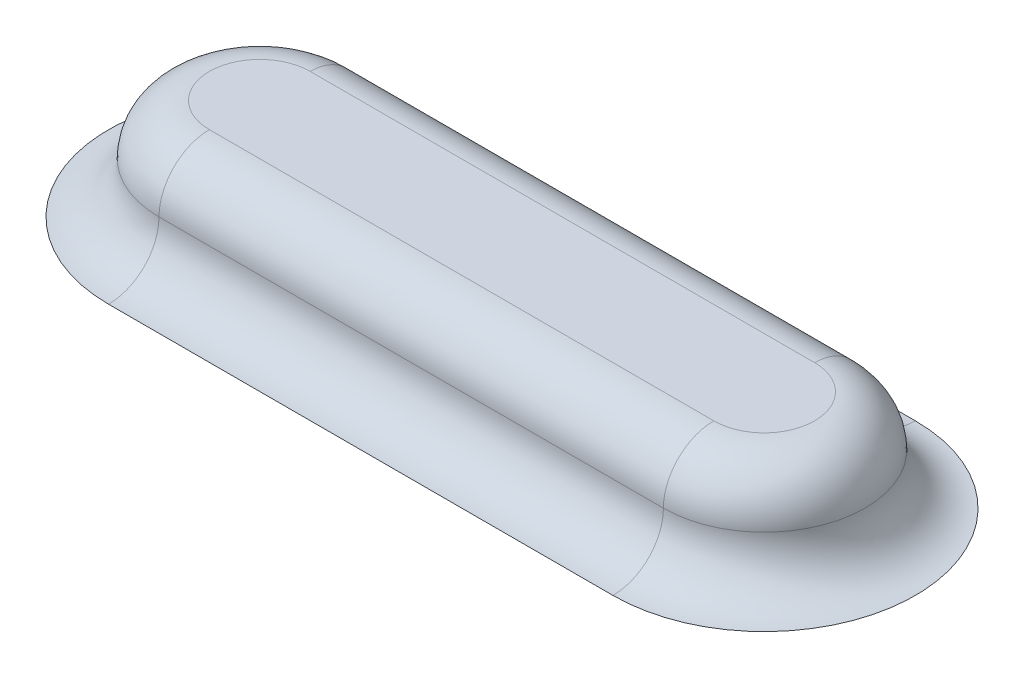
ISO-10303-21;
HEADER;
FILE_DESCRIPTION(('STEP AP214'),'2;1');
FILE_NAME('part.step','',(''),(''),'','','');
FILE_SCHEMA(('AUTOMOTIVE_DESIGN { 1 0 10303 214 1 1 1 1 }'));
ENDSEC;
DATA;
#1=APPLICATION_CONTEXT('core data for automotive mechanical design processes');
#2=APPLICATION_PROTOCOL_DEFINITION('international standard','automotive_design',2000,#1);
#3=PRODUCT_CONTEXT('',#1,'mechanical');
#4=PRODUCT('Part','Part','',(#3));
#5=PRODUCT_RELATED_PRODUCT_CATEGORY('part','',(#4));
#6=PRODUCT_DEFINITION_FORMATION('','',#4);
#7=PRODUCT_DEFINITION_CONTEXT('part definition',#1,'design');
#8=PRODUCT_DEFINITION('design','',#6,#7);
#9=PRODUCT_DEFINITION_SHAPE('','',#8);
#10=(LENGTH_UNIT() NAMED_UNIT(*) SI_UNIT(.MILLI.,.METRE.));
#11=(NAMED_UNIT(*) PLANE_ANGLE_UNIT() SI_UNIT($,.RADIAN.));
#12=(NAMED_UNIT(*) SI_UNIT($,.STERADIAN.) SOLID_ANGLE_UNIT());
#13=UNCERTAINTY_MEASURE_WITH_UNIT(LENGTH_MEASURE(1.E-05),#10,'distance_accuracy_value','');
#14=(GEOMETRIC_REPRESENTATION_CONTEXT(3) GLOBAL_UNCERTAINTY_ASSIGNED_CONTEXT((#13)) GLOBAL_UNIT_ASSIGNED_CONTEXT((#10,
#11,#12)) REPRESENTATION_CONTEXT('',''));
#15=CARTESIAN_POINT('',(0.,0.,0.));
#16=DIRECTION('',(0.,0.,1.));
#17=DIRECTION('',(1.,0.,0.));
#18=AXIS2_PLACEMENT_3D('',#15,#16,#17);
#19=CARTESIAN_POINT('',(-37.1109645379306,44.196,0.));
#20=DIRECTION('',(0.,-1.,0.));
#21=DIRECTION('',(0.,0.,-1.));
#22=AXIS2_PLACEMENT_3D('',#19,#20,#21);
#23=PLANE('',#22);
#24=DIRECTION('',(-1.,0.,0.));
#25=VECTOR('',#24,1.);
#26=CARTESIAN_POINT('',(-37.1109645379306,44.196,-6.35));
#27=LINE('',#26,#25);
#28=CARTESIAN_POINT('',(26.4338638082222,44.196,-6.35));
#29=VERTEX_POINT('',#28);
#30=CARTESIAN_POINT('',(-37.1109645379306,44.196,-6.35));
#31=VERTEX_POINT('',#30);
#32=EDGE_CURVE('E52',#29,#31,#27,.T.);
#33=ORIENTED_EDGE('',*,*,#32,.T.);
#34=CARTESIAN_POINT('',(-37.1109645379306,44.196,0.));
#35=DIRECTION('',(0.,-1.,0.));
#36=DIRECTION('',(0.,0.,-1.));
#37=AXIS2_PLACEMENT_3D('',#34,#35,#36);
#38=CIRCLE('',#37,6.35);
#39=CARTESIAN_POINT('',(-37.1109645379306,44.196,6.35));
#40=VERTEX_POINT('',#39);
#41=EDGE_CURVE('E105',#31,#40,#38,.F.);
#42=ORIENTED_EDGE('',*,*,#41,.T.);
#43=DIRECTION('',(1.,0.,0.));
#44=VECTOR('',#43,1.);
#45=CARTESIAN_POINT('',(-37.1109645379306,44.196,6.35));
#46=LINE('',#45,#44);
#47=CARTESIAN_POINT('',(26.4338638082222,44.196,6.35));
#48=VERTEX_POINT('',#47);
#49=EDGE_CURVE('E110',#40,#48,#46,.T.);
#50=ORIENTED_EDGE('',*,*,#49,.T.);
#51=CARTESIAN_POINT('',(26.4338638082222,44.196,0.));
#52=DIRECTION('',(0.,-1.,0.));
#53=DIRECTION('',(0.,0.,-1.));
#54=AXIS2_PLACEMENT_3D('',#51,#52,#53);
#55=CIRCLE('',#54,6.35);
#56=EDGE_CURVE('E108',#48,#29,#55,.F.);
#57=ORIENTED_EDGE('',*,*,#56,.T.);
#58=EDGE_LOOP('',(#33,#42,#50,#57));
#59=FACE_BOUND('',#58,.T.);
#60=ADVANCED_FACE('F31',(#59),#23,.F.);
#61=CARTESIAN_POINT('',(26.4338638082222,37.846,0.));
#62=DIRECTION('',(0.,1.,0.));
#63=DIRECTION('',(0.,0.,1.));
#64=AXIS2_PLACEMENT_3D('',#61,#62,#63);
#65=TOROIDAL_SURFACE('',#64,19.05,6.35);
#66=CARTESIAN_POINT('',(26.4338638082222,37.846,19.05));
#67=DIRECTION('',(1.,0.,0.));
#68=DIRECTION('',(0.,0.,-1.));
#69=AXIS2_PLACEMENT_3D('',#66,#67,#68);
#70=CIRCLE('',#69,6.35);
#71=CARTESIAN_POINT('',(26.4338638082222,31.496,19.05));
#72=VERTEX_POINT('',#71);
#73=CARTESIAN_POINT('',(26.4338638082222,37.846,12.7));
#74=VERTEX_POINT('',#73);
#75=EDGE_CURVE('E116',#72,#74,#70,.T.);
#76=ORIENTED_EDGE('',*,*,#75,.F.);
#77=CARTESIAN_POINT('',(26.4338638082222,31.496,0.));
#78=DIRECTION('',(0.,1.,0.));
#79=DIRECTION('',(0.,0.,1.));
#80=AXIS2_PLACEMENT_3D('',#77,#78,#79);
#81=CIRCLE('',#80,19.05);
#82=CARTESIAN_POINT('',(26.4338638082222,31.496,-19.05));
#83=VERTEX_POINT('',#82);
#84=EDGE_CURVE('E101',#83,#72,#81,.F.);
#85=ORIENTED_EDGE('',*,*,#84,.F.);
#86=CARTESIAN_POINT('',(26.4338638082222,37.846,-19.05));
#87=DIRECTION('',(1.,0.,0.));
#88=DIRECTION('',(0.,0.,-1.));
#89=AXIS2_PLACEMENT_3D('',#86,#87,#88);
#90=CIRCLE('',#89,6.35);
#91=CARTESIAN_POINT('',(26.4338638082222,37.846,-12.7));
#92=VERTEX_POINT('',#91);
#93=EDGE_CURVE('E100',#92,#83,#90,.T.);
#94=ORIENTED_EDGE('',*,*,#93,.F.);
#95=CARTESIAN_POINT('',(26.4338638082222,37.846,0.));
#96=DIRECTION('',(0.,1.,0.));
#97=DIRECTION('',(0.,0.,1.));
#98=AXIS2_PLACEMENT_3D('',#95,#96,#97);
#99=CIRCLE('',#98,12.7);
#100=EDGE_CURVE('E113',#74,#92,#99,.T.);
#101=ORIENTED_EDGE('',*,*,#100,.F.);
#102=EDGE_LOOP('',(#76,#85,#94,#101));
#103=FACE_BOUND('',#102,.T.);
#104=ADVANCED_FACE('F144',(#103),#65,.F.);
#105=CARTESIAN_POINT('',(-37.1109645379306,37.846,-19.05));
#106=DIRECTION('',(-1.,0.,0.));
#107=DIRECTION('',(0.,0.,1.));
#108=AXIS2_PLACEMENT_3D('',#105,#106,#107);
#109=CYLINDRICAL_SURFACE('',#108,6.35);
#110=ORIENTED_EDGE('',*,*,#93,.T.);
#111=DIRECTION('',(-1.,0.,0.));
#112=VECTOR('',#111,1.);
#113=CARTESIAN_POINT('',(-120.815077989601,31.496,-19.05));
#114=LINE('',#113,#112);
#115=CARTESIAN_POINT('',(-37.1109645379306,31.496,-19.05));
#116=VERTEX_POINT('',#115);
#117=EDGE_CURVE('E38',#116,#83,#114,.F.);
#118=ORIENTED_EDGE('',*,*,#117,.F.);
#119=CARTESIAN_POINT('',(-37.1109645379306,37.846,-19.05));
#120=DIRECTION('',(1.,0.,0.));
#121=DIRECTION('',(0.,0.,-1.));
#122=AXIS2_PLACEMENT_3D('',#119,#120,#121);
#123=CIRCLE('',#122,6.35);
#124=CARTESIAN_POINT('',(-37.1109645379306,37.846,-12.7));
#125=VERTEX_POINT('',#124);
#126=EDGE_CURVE('E87',#125,#116,#123,.T.);
#127=ORIENTED_EDGE('',*,*,#126,.F.);
#128=DIRECTION('',(-1.,0.,0.));
#129=VECTOR('',#128,1.);
#130=CARTESIAN_POINT('',(-37.1109645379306,37.846,-12.7));
#131=LINE('',#130,#129);
#132=EDGE_CURVE('E96',#92,#125,#131,.T.);
#133=ORIENTED_EDGE('',*,*,#132,.F.);
#134=EDGE_LOOP('',(#110,#118,#127,#133));
#135=FACE_BOUND('',#134,.T.);
#136=ADVANCED_FACE('F99',(#135),#109,.F.);
#137=CARTESIAN_POINT('',(26.4338638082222,37.846,0.));
#138=DIRECTION('',(0.,-1.,0.));
#139=DIRECTION('',(0.,0.,-1.));
#140=AXIS2_PLACEMENT_3D('',#137,#138,#139);
#141=DEGENERATE_TOROIDAL_SURFACE('',#140,6.35,6.35,.T.);
#142=CARTESIAN_POINT('',(26.4338638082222,37.846,6.35));
#143=DIRECTION('',(-1.,0.,0.));
#144=DIRECTION('',(0.,0.,1.));
#145=AXIS2_PLACEMENT_3D('',#142,#143,#144);
#146=CIRCLE('',#145,6.35);
#147=EDGE_CURVE('E124',#74,#48,#146,.T.);
#148=ORIENTED_EDGE('',*,*,#147,.F.);
#149=ORIENTED_EDGE('',*,*,#100,.T.);
#150=CARTESIAN_POINT('',(26.4338638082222,37.846,-6.35));
#151=DIRECTION('',(-1.,0.,0.));
#152=DIRECTION('',(0.,0.,1.));
#153=AXIS2_PLACEMENT_3D('',#150,#151,#152);
#154=CIRCLE('',#153,6.35);
#155=EDGE_CURVE('E121',#29,#92,#154,.T.);
#156=ORIENTED_EDGE('',*,*,#155,.F.);
#157=ORIENTED_EDGE('',*,*,#56,.F.);
#158=EDGE_LOOP('',(#148,#149,#156,#157));
#159=FACE_BOUND('',#158,.T.);
#160=ADVANCED_FACE('F152',(#159),#141,.T.);
#161=CARTESIAN_POINT('',(-37.1109645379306,37.846,19.05));
#162=DIRECTION('',(1.,0.,0.));
#163=DIRECTION('',(0.,0.,-1.));
#164=AXIS2_PLACEMENT_3D('',#161,#162,#163);
#165=CYLINDRICAL_SURFACE('',#164,6.35);
#166=CARTESIAN_POINT('',(-37.1109645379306,37.846,19.05));
#167=DIRECTION('',(1.,0.,0.));
#168=DIRECTION('',(0.,0.,-1.));
#169=AXIS2_PLACEMENT_3D('',#166,#167,#168);
#170=CIRCLE('',#169,6.35);
#171=CARTESIAN_POINT('',(-37.1109645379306,31.496,19.05));
#172=VERTEX_POINT('',#171);
#173=CARTESIAN_POINT('',(-37.1109645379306,37.846,12.7));
#174=VERTEX_POINT('',#173);
#175=EDGE_CURVE('E95',#172,#174,#170,.T.);
#176=ORIENTED_EDGE('',*,*,#175,.F.);
#177=DIRECTION('',(1.,0.,0.));
#178=VECTOR('',#177,1.);
#179=CARTESIAN_POINT('',(-120.815077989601,31.496,19.05));
#180=LINE('',#179,#178);
#181=EDGE_CURVE('E44',#72,#172,#180,.F.);
#182=ORIENTED_EDGE('',*,*,#181,.F.);
#183=ORIENTED_EDGE('',*,*,#75,.T.);
#184=DIRECTION('',(1.,0.,0.));
#185=VECTOR('',#184,1.);
#186=CARTESIAN_POINT('',(-37.1109645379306,37.846,12.7));
#187=LINE('',#186,#185);
#188=EDGE_CURVE('E127',#174,#74,#187,.T.);
#189=ORIENTED_EDGE('',*,*,#188,.F.);
#190=EDGE_LOOP('',(#176,#182,#183,#189));
#191=FACE_BOUND('',#190,.T.);
#192=ADVANCED_FACE('F158',(#191),#165,.F.);
#193=CARTESIAN_POINT('',(-37.1109645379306,37.846,0.));
#194=DIRECTION('',(0.,1.,0.));
#195=DIRECTION('',(0.,0.,1.));
#196=AXIS2_PLACEMENT_3D('',#193,#194,#195);
#197=TOROIDAL_SURFACE('',#196,19.05,6.35);
#198=CARTESIAN_POINT('',(-37.1109645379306,31.496,0.));
#199=DIRECTION('',(0.,1.,0.));
#200=DIRECTION('',(0.,0.,1.));
#201=AXIS2_PLACEMENT_3D('',#198,#199,#200);
#202=CIRCLE('',#201,19.05);
#203=EDGE_CURVE('E11',#172,#116,#202,.F.);
#204=ORIENTED_EDGE('',*,*,#203,.F.);
#205=ORIENTED_EDGE('',*,*,#175,.T.);
#206=CARTESIAN_POINT('',(-37.1109645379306,37.846,0.));
#207=DIRECTION('',(0.,1.,0.));
#208=DIRECTION('',(0.,0.,1.));
#209=AXIS2_PLACEMENT_3D('',#206,#207,#208);
#210=CIRCLE('',#209,12.7);
#211=EDGE_CURVE('E90',#125,#174,#210,.T.);
#212=ORIENTED_EDGE('',*,*,#211,.F.);
#213=ORIENTED_EDGE('',*,*,#126,.T.);
#214=EDGE_LOOP('',(#204,#205,#212,#213));
#215=FACE_BOUND('',#214,.T.);
#216=ADVANCED_FACE('F88',(#215),#197,.F.);
#217=CARTESIAN_POINT('',(-37.1109645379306,37.846,-6.35));
#218=DIRECTION('',(-1.,0.,0.));
#219=DIRECTION('',(0.,0.,1.));
#220=AXIS2_PLACEMENT_3D('',#217,#218,#219);
#221=CYLINDRICAL_SURFACE('',#220,6.35);
#222=ORIENTED_EDGE('',*,*,#155,.T.);
#223=ORIENTED_EDGE('',*,*,#132,.T.);
#224=CARTESIAN_POINT('',(-37.1109645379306,37.846,-6.35));
#225=DIRECTION('',(-1.,0.,0.));
#226=DIRECTION('',(0.,0.,1.));
#227=AXIS2_PLACEMENT_3D('',#224,#225,#226);
#228=CIRCLE('',#227,6.35);
#229=EDGE_CURVE('E131',#31,#125,#228,.T.);
#230=ORIENTED_EDGE('',*,*,#229,.F.);
#231=ORIENTED_EDGE('',*,*,#32,.F.);
#232=EDGE_LOOP('',(#222,#223,#230,#231));
#233=FACE_BOUND('',#232,.T.);
#234=ADVANCED_FACE('F165',(#233),#221,.T.);
#235=CARTESIAN_POINT('',(-37.1109645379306,37.846,6.35));
#236=DIRECTION('',(1.,0.,0.));
#237=DIRECTION('',(0.,0.,-1.));
#238=AXIS2_PLACEMENT_3D('',#235,#236,#237);
#239=CYLINDRICAL_SURFACE('',#238,6.35);
#240=ORIENTED_EDGE('',*,*,#147,.T.);
#241=ORIENTED_EDGE('',*,*,#49,.F.);
#242=CARTESIAN_POINT('',(-37.1109645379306,37.846,6.35));
#243=DIRECTION('',(-1.,0.,0.));
#244=DIRECTION('',(0.,0.,1.));
#245=AXIS2_PLACEMENT_3D('',#242,#243,#244);
#246=CIRCLE('',#245,6.35);
#247=EDGE_CURVE('E133',#174,#40,#246,.T.);
#248=ORIENTED_EDGE('',*,*,#247,.F.);
#249=ORIENTED_EDGE('',*,*,#188,.T.);
#250=EDGE_LOOP('',(#240,#241,#248,#249));
#251=FACE_BOUND('',#250,.T.);
#252=ADVANCED_FACE('F140',(#251),#239,.T.);
#253=CARTESIAN_POINT('',(-37.1109645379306,37.846,0.));
#254=DIRECTION('',(0.,-1.,0.));
#255=DIRECTION('',(0.,0.,-1.));
#256=AXIS2_PLACEMENT_3D('',#253,#254,#255);
#257=DEGENERATE_TOROIDAL_SURFACE('',#256,6.35,6.35,.T.);
#258=ORIENTED_EDGE('',*,*,#229,.T.);
#259=ORIENTED_EDGE('',*,*,#211,.T.);
#260=ORIENTED_EDGE('',*,*,#247,.T.);
#261=ORIENTED_EDGE('',*,*,#41,.F.);
#262=EDGE_LOOP('',(#258,#259,#260,#261));
#263=FACE_BOUND('',#262,.T.);
#264=ADVANCED_FACE('F138',(#263),#257,.T.);
#265=CARTESIAN_POINT('',(-120.815077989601,31.496,-90.7928942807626));
#266=DIRECTION('',(0.,1.,0.));
#267=DIRECTION('',(0.,0.,1.));
#268=AXIS2_PLACEMENT_3D('',#265,#266,#267);
#269=PLANE('',#268);
#270=ORIENTED_EDGE('',*,*,#84,.T.);
#271=ORIENTED_EDGE('',*,*,#181,.T.);
#272=ORIENTED_EDGE('',*,*,#203,.T.);
#273=ORIENTED_EDGE('',*,*,#117,.T.);
#274=EDGE_LOOP('',(#270,#271,#272,#273));
#275=FACE_BOUND('',#274,.T.);
#276=ADVANCED_FACE('F82',(#275),#269,.F.);
#277=CLOSED_SHELL('',(#60,#104,#136,#160,#192,#216,#234,#252,#264,#276));
#278=MANIFOLD_SOLID_BREP('B2',#277);
#279=ADVANCED_BREP_SHAPE_REPRESENTATION('',(#18,#278),#14);
#280=SHAPE_DEFINITION_REPRESENTATION(#9,#279);
ENDSEC;
END-ISO-10303-21;
